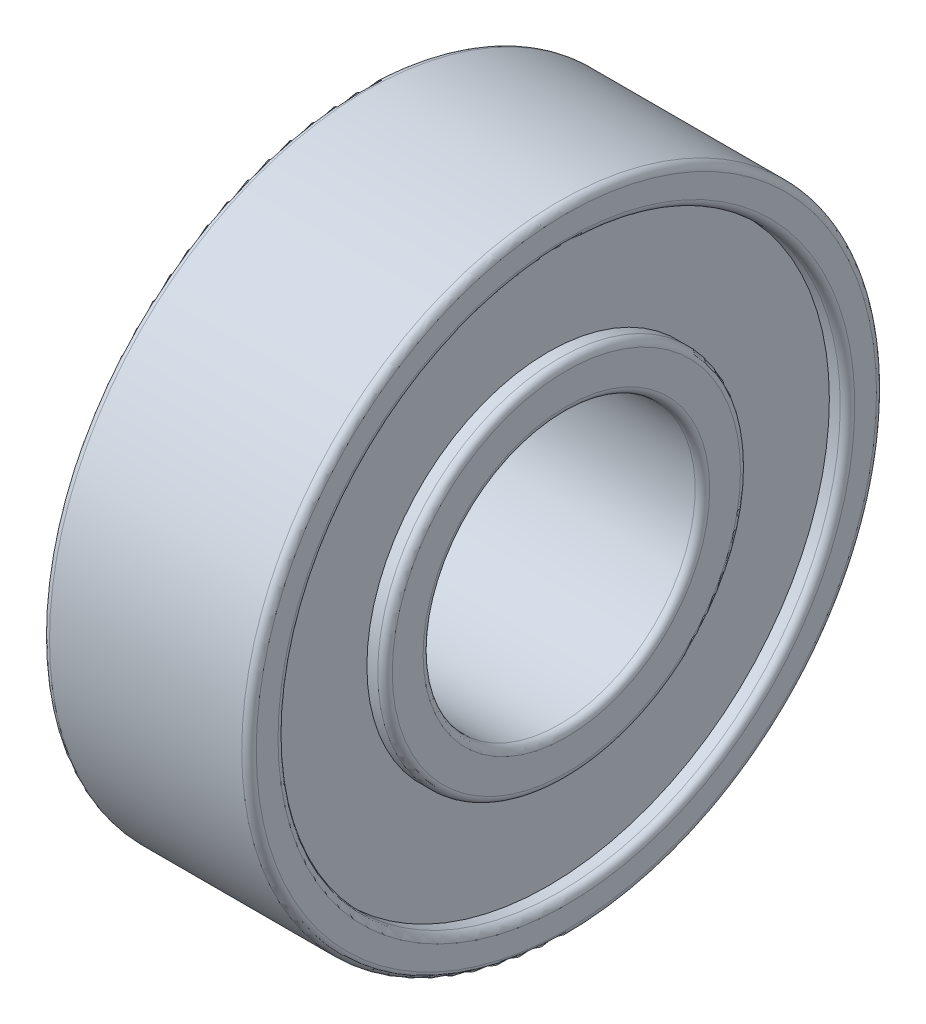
from build123d import *


with BuildPart() as part:
    # Sketch2 → Revolve1 (revolve)
    with BuildSketch(Plane.XY, mode=Mode.PRIVATE) as revolve1_sk:
        with BuildLine():
            Line((-2.9845, 9.8425), (-2.9845, 6.35))
            Line((-2.9845, 6.35), (-3.3655, 6.35))
            ThreePointArc((-3.3655, 6.35), (-3.545105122, 6.275605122), (-3.6195, 6.096))
            Line((-3.6195, 6.096), (-3.6195, 5.0165))
            ThreePointArc((-3.6195, 5.0165), (-3.545105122, 4.836894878), (-3.3655, 4.7625))
            Line((-3.3655, 4.7625), (3.3655, 4.7625))
            ThreePointArc((3.3655, 4.7625), (3.545105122, 4.836894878), (3.6195, 5.0165))
            Line((3.6195, 5.0165), (3.6195, 6.096))
            ThreePointArc((3.6195, 6.096), (3.545105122, 6.275605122), (3.3655, 6.35))
            Line((3.3655, 6.35), (2.9845, 6.35))
            Line((2.9845, 6.35), (2.9845, 9.8425))
            Line((2.9845, 9.8425), (3.3655, 9.8425))
            ThreePointArc((3.3655, 9.8425), (3.545105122, 9.916894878), (3.6195, 10.0965))
            Line((3.6195, 10.0965), (3.6195, 10.8585))
            ThreePointArc((3.6195, 10.8585), (3.545105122, 11.038105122), (3.3655, 11.1125))
            Line((3.3655, 11.1125), (-3.3655, 11.1125))
            ThreePointArc((-3.3655, 11.1125), (-3.545105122, 11.038105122), (-3.6195, 10.8585))
            Line((-3.6195, 10.8585), (-3.6195, 10.0965))
            ThreePointArc((-3.6195, 10.0965), (-3.545105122, 9.916894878), (-3.3655, 9.8425))
            Line((-3.3655, 9.8425), (-2.9845, 9.8425))
        make_face()
    revolve(revolve1_sk.sketch.rotate(Axis((-3.049373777, 0, 0), (1, 0, 0)), 90), axis=Axis((-3.049373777, 0, 0), (1, 0, 0)))


solid = part.part
